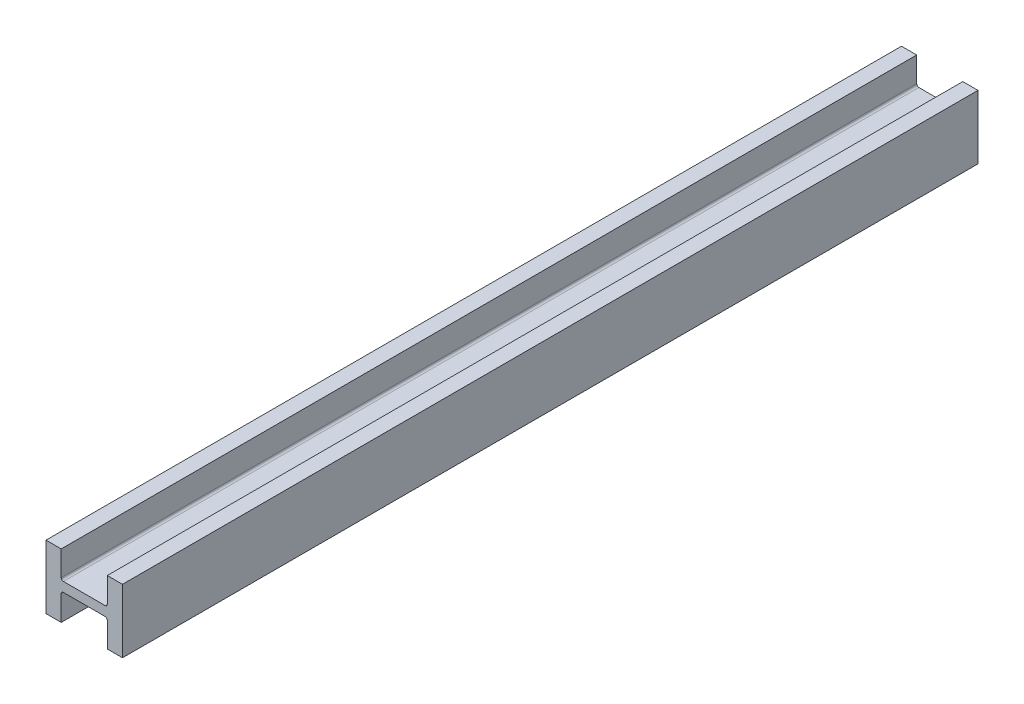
ISO-10303-21;
HEADER;
FILE_DESCRIPTION(('STEP AP214'),'2;1');
FILE_NAME('part.step','',(''),(''),'','','');
FILE_SCHEMA(('AUTOMOTIVE_DESIGN { 1 0 10303 214 1 1 1 1 }'));
ENDSEC;
DATA;
#1=APPLICATION_CONTEXT('core data for automotive mechanical design processes');
#2=APPLICATION_PROTOCOL_DEFINITION('international standard','automotive_design',2000,#1);
#3=PRODUCT_CONTEXT('',#1,'mechanical');
#4=PRODUCT('Part','Part','',(#3));
#5=PRODUCT_RELATED_PRODUCT_CATEGORY('part','',(#4));
#6=PRODUCT_DEFINITION_FORMATION('','',#4);
#7=PRODUCT_DEFINITION_CONTEXT('part definition',#1,'design');
#8=PRODUCT_DEFINITION('design','',#6,#7);
#9=PRODUCT_DEFINITION_SHAPE('','',#8);
#10=(LENGTH_UNIT() NAMED_UNIT(*) SI_UNIT(.MILLI.,.METRE.));
#11=(NAMED_UNIT(*) PLANE_ANGLE_UNIT() SI_UNIT($,.RADIAN.));
#12=(NAMED_UNIT(*) SI_UNIT($,.STERADIAN.) SOLID_ANGLE_UNIT());
#13=UNCERTAINTY_MEASURE_WITH_UNIT(LENGTH_MEASURE(1.E-05),#10,'distance_accuracy_value','');
#14=(GEOMETRIC_REPRESENTATION_CONTEXT(3) GLOBAL_UNCERTAINTY_ASSIGNED_CONTEXT((#13)) GLOBAL_UNIT_ASSIGNED_CONTEXT((#10,
#11,#12)) REPRESENTATION_CONTEXT('',''));
#15=CARTESIAN_POINT('',(0.,0.,0.));
#16=DIRECTION('',(0.,0.,1.));
#17=DIRECTION('',(1.,0.,0.));
#18=AXIS2_PLACEMENT_3D('',#15,#16,#17);
#19=CARTESIAN_POINT('',(265.684,221.1705,2971.8));
#20=DIRECTION('',(-1.,0.,0.));
#21=DIRECTION('',(0.,0.,1.));
#22=AXIS2_PLACEMENT_3D('',#19,#20,#21);
#23=PLANE('',#22);
#24=DIRECTION('',(0.,1.,0.));
#25=VECTOR('',#24,1.);
#26=CARTESIAN_POINT('',(265.684,221.1705,-2971.8));
#27=LINE('',#26,#25);
#28=CARTESIAN_POINT('',(265.684,-221.1705,-2971.8));
#29=VERTEX_POINT('',#28);
#30=CARTESIAN_POINT('',(265.684,221.1705,-2971.8));
#31=VERTEX_POINT('',#30);
#32=EDGE_CURVE('E194',#29,#31,#27,.T.);
#33=ORIENTED_EDGE('',*,*,#32,.T.);
#34=DIRECTION('',(0.,0.,-1.));
#35=VECTOR('',#34,1.);
#36=CARTESIAN_POINT('',(265.684,221.1705,2971.8));
#37=LINE('',#36,#35);
#38=CARTESIAN_POINT('',(265.684,221.1705,2971.8));
#39=VERTEX_POINT('',#38);
#40=EDGE_CURVE('E11',#39,#31,#37,.T.);
#41=ORIENTED_EDGE('',*,*,#40,.F.);
#42=DIRECTION('',(0.,1.,0.));
#43=VECTOR('',#42,1.);
#44=CARTESIAN_POINT('',(265.684,221.1705,2971.8));
#45=LINE('',#44,#43);
#46=CARTESIAN_POINT('',(265.684,-221.1705,2971.8));
#47=VERTEX_POINT('',#46);
#48=EDGE_CURVE('E238',#47,#39,#45,.T.);
#49=ORIENTED_EDGE('',*,*,#48,.F.);
#50=DIRECTION('',(0.,0.,-1.));
#51=VECTOR('',#50,1.);
#52=CARTESIAN_POINT('',(265.684,-221.1705,2971.8));
#53=LINE('',#52,#51);
#54=EDGE_CURVE('E189',#47,#29,#53,.T.);
#55=ORIENTED_EDGE('',*,*,#54,.T.);
#56=EDGE_LOOP('',(#33,#41,#49,#55));
#57=FACE_BOUND('',#56,.T.);
#58=ADVANCED_FACE('F44',(#57),#23,.F.);
#59=CARTESIAN_POINT('',(160.02,221.1705,2971.8));
#60=DIRECTION('',(0.,-1.,0.));
#61=DIRECTION('',(0.,0.,-1.));
#62=AXIS2_PLACEMENT_3D('',#59,#60,#61);
#63=PLANE('',#62);
#64=DIRECTION('',(-1.,0.,0.));
#65=VECTOR('',#64,1.);
#66=CARTESIAN_POINT('',(160.02,221.1705,-2971.8));
#67=LINE('',#66,#65);
#68=CARTESIAN_POINT('',(160.02,221.1705,-2971.8));
#69=VERTEX_POINT('',#68);
#70=EDGE_CURVE('E196',#31,#69,#67,.T.);
#71=ORIENTED_EDGE('',*,*,#70,.T.);
#72=DIRECTION('',(0.,0.,-1.));
#73=VECTOR('',#72,1.);
#74=CARTESIAN_POINT('',(160.02,221.1705,2971.8));
#75=LINE('',#74,#73);
#76=CARTESIAN_POINT('',(160.02,221.1705,2971.8));
#77=VERTEX_POINT('',#76);
#78=EDGE_CURVE('E53',#77,#69,#75,.T.);
#79=ORIENTED_EDGE('',*,*,#78,.F.);
#80=DIRECTION('',(-1.,0.,0.));
#81=VECTOR('',#80,1.);
#82=CARTESIAN_POINT('',(160.02,221.1705,2971.8));
#83=LINE('',#82,#81);
#84=EDGE_CURVE('E129',#39,#77,#83,.T.);
#85=ORIENTED_EDGE('',*,*,#84,.F.);
#86=ORIENTED_EDGE('',*,*,#40,.T.);
#87=EDGE_LOOP('',(#71,#79,#85,#86));
#88=FACE_BOUND('',#87,.T.);
#89=ADVANCED_FACE('F362',(#88),#63,.F.);
#90=CARTESIAN_POINT('',(160.02,48.1965,2971.8));
#91=DIRECTION('',(1.,0.,0.));
#92=DIRECTION('',(0.,0.,-1.));
#93=AXIS2_PLACEMENT_3D('',#90,#91,#92);
#94=PLANE('',#93);
#95=DIRECTION('',(0.,-1.,0.));
#96=VECTOR('',#95,1.);
#97=CARTESIAN_POINT('',(160.02,48.1965,-2971.8));
#98=LINE('',#97,#96);
#99=CARTESIAN_POINT('',(160.02,48.1965,-2971.8));
#100=VERTEX_POINT('',#99);
#101=EDGE_CURVE('E203',#69,#100,#98,.T.);
#102=ORIENTED_EDGE('',*,*,#101,.T.);
#103=DIRECTION('',(0.,0.,-1.));
#104=VECTOR('',#103,1.);
#105=CARTESIAN_POINT('',(160.02,48.1965,2971.8));
#106=LINE('',#105,#104);
#107=CARTESIAN_POINT('',(160.02,48.1965,2971.8));
#108=VERTEX_POINT('',#107);
#109=EDGE_CURVE('E282',#108,#100,#106,.T.);
#110=ORIENTED_EDGE('',*,*,#109,.F.);
#111=DIRECTION('',(0.,-1.,0.));
#112=VECTOR('',#111,1.);
#113=CARTESIAN_POINT('',(160.02,48.1965,2971.8));
#114=LINE('',#113,#112);
#115=EDGE_CURVE('E291',#77,#108,#114,.T.);
#116=ORIENTED_EDGE('',*,*,#115,.F.);
#117=ORIENTED_EDGE('',*,*,#78,.T.);
#118=EDGE_LOOP('',(#102,#110,#116,#117));
#119=FACE_BOUND('',#118,.T.);
#120=ADVANCED_FACE('F292',(#119),#94,.F.);
#121=CARTESIAN_POINT('',(144.78,48.1965,2971.8));
#122=DIRECTION('',(0.,0.,-1.));
#123=DIRECTION('',(-1.,0.,0.));
#124=AXIS2_PLACEMENT_3D('',#121,#122,#123);
#125=CYLINDRICAL_SURFACE('',#124,15.24);
#126=CARTESIAN_POINT('',(144.78,48.1965,-2971.8));
#127=DIRECTION('',(0.,0.,-1.));
#128=DIRECTION('',(1.,0.,0.));
#129=AXIS2_PLACEMENT_3D('',#126,#127,#128);
#130=CIRCLE('',#129,15.24);
#131=CARTESIAN_POINT('',(144.78,32.9565,-2971.8));
#132=VERTEX_POINT('',#131);
#133=EDGE_CURVE('E204',#100,#132,#130,.T.);
#134=ORIENTED_EDGE('',*,*,#133,.T.);
#135=DIRECTION('',(0.,0.,-1.));
#136=VECTOR('',#135,1.);
#137=CARTESIAN_POINT('',(144.78,32.9565,2971.8));
#138=LINE('',#137,#136);
#139=CARTESIAN_POINT('',(144.78,32.9565,2971.8));
#140=VERTEX_POINT('',#139);
#141=EDGE_CURVE('E276',#140,#132,#138,.T.);
#142=ORIENTED_EDGE('',*,*,#141,.F.);
#143=CARTESIAN_POINT('',(144.78,48.1965,2971.8));
#144=DIRECTION('',(0.,0.,-1.));
#145=DIRECTION('',(1.,0.,0.));
#146=AXIS2_PLACEMENT_3D('',#143,#144,#145);
#147=CIRCLE('',#146,15.24);
#148=EDGE_CURVE('E315',#108,#140,#147,.T.);
#149=ORIENTED_EDGE('',*,*,#148,.F.);
#150=ORIENTED_EDGE('',*,*,#109,.T.);
#151=EDGE_LOOP('',(#134,#142,#149,#150));
#152=FACE_BOUND('',#151,.T.);
#153=ADVANCED_FACE('F305',(#152),#125,.F.);
#154=CARTESIAN_POINT('',(-144.78,32.9565,2971.8));
#155=DIRECTION('',(0.,-1.,0.));
#156=DIRECTION('',(1.,0.,0.));
#157=AXIS2_PLACEMENT_3D('',#154,#155,#156);
#158=PLANE('',#157);
#159=DIRECTION('',(-1.,0.,0.));
#160=VECTOR('',#159,1.);
#161=CARTESIAN_POINT('',(-144.78,32.9565,-2971.8));
#162=LINE('',#161,#160);
#163=CARTESIAN_POINT('',(-144.78,32.9565,-2971.8));
#164=VERTEX_POINT('',#163);
#165=EDGE_CURVE('E210',#132,#164,#162,.T.);
#166=ORIENTED_EDGE('',*,*,#165,.T.);
#167=DIRECTION('',(0.,0.,-1.));
#168=VECTOR('',#167,1.);
#169=CARTESIAN_POINT('',(-144.78,32.9565,2971.8));
#170=LINE('',#169,#168);
#171=CARTESIAN_POINT('',(-144.78,32.9565,2971.8));
#172=VERTEX_POINT('',#171);
#173=EDGE_CURVE('E274',#172,#164,#170,.T.);
#174=ORIENTED_EDGE('',*,*,#173,.F.);
#175=DIRECTION('',(-1.,0.,0.));
#176=VECTOR('',#175,1.);
#177=CARTESIAN_POINT('',(-144.78,32.9565,2971.8));
#178=LINE('',#177,#176);
#179=EDGE_CURVE('E306',#140,#172,#178,.T.);
#180=ORIENTED_EDGE('',*,*,#179,.F.);
#181=ORIENTED_EDGE('',*,*,#141,.T.);
#182=EDGE_LOOP('',(#166,#174,#180,#181));
#183=FACE_BOUND('',#182,.T.);
#184=ADVANCED_FACE('F308',(#183),#158,.F.);
#185=CARTESIAN_POINT('',(-144.78,48.1965,2971.8));
#186=DIRECTION('',(0.,0.,-1.));
#187=DIRECTION('',(-1.,0.,0.));
#188=AXIS2_PLACEMENT_3D('',#185,#186,#187);
#189=CYLINDRICAL_SURFACE('',#188,15.24);
#190=CARTESIAN_POINT('',(-144.78,48.1965,-2971.8));
#191=DIRECTION('',(0.,0.,-1.));
#192=DIRECTION('',(1.,0.,0.));
#193=AXIS2_PLACEMENT_3D('',#190,#191,#192);
#194=CIRCLE('',#193,15.24);
#195=CARTESIAN_POINT('',(-160.02,48.1965,-2971.8));
#196=VERTEX_POINT('',#195);
#197=EDGE_CURVE('E209',#164,#196,#194,.T.);
#198=ORIENTED_EDGE('',*,*,#197,.T.);
#199=DIRECTION('',(0.,0.,-1.));
#200=VECTOR('',#199,1.);
#201=CARTESIAN_POINT('',(-160.02,48.1965,2971.8));
#202=LINE('',#201,#200);
#203=CARTESIAN_POINT('',(-160.02,48.1965,2971.8));
#204=VERTEX_POINT('',#203);
#205=EDGE_CURVE('E271',#204,#196,#202,.T.);
#206=ORIENTED_EDGE('',*,*,#205,.F.);
#207=CARTESIAN_POINT('',(-144.78,48.1965,2971.8));
#208=DIRECTION('',(0.,0.,-1.));
#209=DIRECTION('',(1.,0.,0.));
#210=AXIS2_PLACEMENT_3D('',#207,#208,#209);
#211=CIRCLE('',#210,15.24);
#212=EDGE_CURVE('E313',#172,#204,#211,.T.);
#213=ORIENTED_EDGE('',*,*,#212,.F.);
#214=ORIENTED_EDGE('',*,*,#173,.T.);
#215=EDGE_LOOP('',(#198,#206,#213,#214));
#216=FACE_BOUND('',#215,.T.);
#217=ADVANCED_FACE('F374',(#216),#189,.F.);
#218=CARTESIAN_POINT('',(-160.02,221.1705,2971.8));
#219=DIRECTION('',(-1.,0.,0.));
#220=DIRECTION('',(0.,0.,1.));
#221=AXIS2_PLACEMENT_3D('',#218,#219,#220);
#222=PLANE('',#221);
#223=DIRECTION('',(0.,1.,0.));
#224=VECTOR('',#223,1.);
#225=CARTESIAN_POINT('',(-160.02,221.1705,-2971.8));
#226=LINE('',#225,#224);
#227=CARTESIAN_POINT('',(-160.02,221.1705,-2971.8));
#228=VERTEX_POINT('',#227);
#229=EDGE_CURVE('E213',#196,#228,#226,.T.);
#230=ORIENTED_EDGE('',*,*,#229,.T.);
#231=DIRECTION('',(0.,0.,-1.));
#232=VECTOR('',#231,1.);
#233=CARTESIAN_POINT('',(-160.02,221.1705,2971.8));
#234=LINE('',#233,#232);
#235=CARTESIAN_POINT('',(-160.02,221.1705,2971.8));
#236=VERTEX_POINT('',#235);
#237=EDGE_CURVE('E270',#236,#228,#234,.T.);
#238=ORIENTED_EDGE('',*,*,#237,.F.);
#239=DIRECTION('',(0.,1.,0.));
#240=VECTOR('',#239,1.);
#241=CARTESIAN_POINT('',(-160.02,221.1705,2971.8));
#242=LINE('',#241,#240);
#243=EDGE_CURVE('E316',#204,#236,#242,.T.);
#244=ORIENTED_EDGE('',*,*,#243,.F.);
#245=ORIENTED_EDGE('',*,*,#205,.T.);
#246=EDGE_LOOP('',(#230,#238,#244,#245));
#247=FACE_BOUND('',#246,.T.);
#248=ADVANCED_FACE('F378',(#247),#222,.F.);
#249=CARTESIAN_POINT('',(-265.684,221.1705,2971.8));
#250=DIRECTION('',(0.,-1.,0.));
#251=DIRECTION('',(0.,0.,-1.));
#252=AXIS2_PLACEMENT_3D('',#249,#250,#251);
#253=PLANE('',#252);
#254=DIRECTION('',(-1.,0.,0.));
#255=VECTOR('',#254,1.);
#256=CARTESIAN_POINT('',(-265.684,221.1705,-2971.8));
#257=LINE('',#256,#255);
#258=CARTESIAN_POINT('',(-265.684,221.1705,-2971.8));
#259=VERTEX_POINT('',#258);
#260=EDGE_CURVE('E216',#228,#259,#257,.T.);
#261=ORIENTED_EDGE('',*,*,#260,.T.);
#262=DIRECTION('',(0.,0.,-1.));
#263=VECTOR('',#262,1.);
#264=CARTESIAN_POINT('',(-265.684,221.1705,2971.8));
#265=LINE('',#264,#263);
#266=CARTESIAN_POINT('',(-265.684,221.1705,2971.8));
#267=VERTEX_POINT('',#266);
#268=EDGE_CURVE('E263',#267,#259,#265,.T.);
#269=ORIENTED_EDGE('',*,*,#268,.F.);
#270=DIRECTION('',(-1.,0.,0.));
#271=VECTOR('',#270,1.);
#272=CARTESIAN_POINT('',(-265.684,221.1705,2971.8));
#273=LINE('',#272,#271);
#274=EDGE_CURVE('E323',#236,#267,#273,.T.);
#275=ORIENTED_EDGE('',*,*,#274,.F.);
#276=ORIENTED_EDGE('',*,*,#237,.T.);
#277=EDGE_LOOP('',(#261,#269,#275,#276));
#278=FACE_BOUND('',#277,.T.);
#279=ADVANCED_FACE('F385',(#278),#253,.F.);
#280=CARTESIAN_POINT('',(-265.684,-221.1705,2971.8));
#281=DIRECTION('',(1.,0.,0.));
#282=DIRECTION('',(0.,0.,-1.));
#283=AXIS2_PLACEMENT_3D('',#280,#281,#282);
#284=PLANE('',#283);
#285=DIRECTION('',(0.,-1.,0.));
#286=VECTOR('',#285,1.);
#287=CARTESIAN_POINT('',(-265.684,-221.1705,-2971.8));
#288=LINE('',#287,#286);
#289=CARTESIAN_POINT('',(-265.684,-221.1705,-2971.8));
#290=VERTEX_POINT('',#289);
#291=EDGE_CURVE('E218',#259,#290,#288,.T.);
#292=ORIENTED_EDGE('',*,*,#291,.T.);
#293=DIRECTION('',(0.,0.,-1.));
#294=VECTOR('',#293,1.);
#295=CARTESIAN_POINT('',(-265.684,-221.1705,2971.8));
#296=LINE('',#295,#294);
#297=CARTESIAN_POINT('',(-265.684,-221.1705,2971.8));
#298=VERTEX_POINT('',#297);
#299=EDGE_CURVE('E259',#298,#290,#296,.T.);
#300=ORIENTED_EDGE('',*,*,#299,.F.);
#301=DIRECTION('',(0.,-1.,0.));
#302=VECTOR('',#301,1.);
#303=CARTESIAN_POINT('',(-265.684,-221.1705,2971.8));
#304=LINE('',#303,#302);
#305=EDGE_CURVE('E326',#267,#298,#304,.T.);
#306=ORIENTED_EDGE('',*,*,#305,.F.);
#307=ORIENTED_EDGE('',*,*,#268,.T.);
#308=EDGE_LOOP('',(#292,#300,#306,#307));
#309=FACE_BOUND('',#308,.T.);
#310=ADVANCED_FACE('F387',(#309),#284,.F.);
#311=CARTESIAN_POINT('',(-160.02,-221.1705,2971.8));
#312=DIRECTION('',(0.,1.,0.));
#313=DIRECTION('',(0.,0.,1.));
#314=AXIS2_PLACEMENT_3D('',#311,#312,#313);
#315=PLANE('',#314);
#316=DIRECTION('',(1.,0.,0.));
#317=VECTOR('',#316,1.);
#318=CARTESIAN_POINT('',(-160.02,-221.1705,-2971.8));
#319=LINE('',#318,#317);
#320=CARTESIAN_POINT('',(-160.02,-221.1705,-2971.8));
#321=VERTEX_POINT('',#320);
#322=EDGE_CURVE('E225',#290,#321,#319,.T.);
#323=ORIENTED_EDGE('',*,*,#322,.T.);
#324=DIRECTION('',(0.,0.,-1.));
#325=VECTOR('',#324,1.);
#326=CARTESIAN_POINT('',(-160.02,-221.1705,2971.8));
#327=LINE('',#326,#325);
#328=CARTESIAN_POINT('',(-160.02,-221.1705,2971.8));
#329=VERTEX_POINT('',#328);
#330=EDGE_CURVE('E254',#329,#321,#327,.T.);
#331=ORIENTED_EDGE('',*,*,#330,.F.);
#332=DIRECTION('',(1.,0.,0.));
#333=VECTOR('',#332,1.);
#334=CARTESIAN_POINT('',(-160.02,-221.1705,2971.8));
#335=LINE('',#334,#333);
#336=EDGE_CURVE('E328',#298,#329,#335,.T.);
#337=ORIENTED_EDGE('',*,*,#336,.F.);
#338=ORIENTED_EDGE('',*,*,#299,.T.);
#339=EDGE_LOOP('',(#323,#331,#337,#338));
#340=FACE_BOUND('',#339,.T.);
#341=ADVANCED_FACE('F388',(#340),#315,.F.);
#342=CARTESIAN_POINT('',(-160.02,-48.1965,2971.8));
#343=DIRECTION('',(-1.,0.,0.));
#344=DIRECTION('',(0.,-1.,0.));
#345=AXIS2_PLACEMENT_3D('',#342,#343,#344);
#346=PLANE('',#345);
#347=DIRECTION('',(0.,1.,0.));
#348=VECTOR('',#347,1.);
#349=CARTESIAN_POINT('',(-160.02,-48.1965,-2971.8));
#350=LINE('',#349,#348);
#351=CARTESIAN_POINT('',(-160.02,-48.1965,-2971.8));
#352=VERTEX_POINT('',#351);
#353=EDGE_CURVE('E223',#321,#352,#350,.T.);
#354=ORIENTED_EDGE('',*,*,#353,.T.);
#355=DIRECTION('',(0.,0.,-1.));
#356=VECTOR('',#355,1.);
#357=CARTESIAN_POINT('',(-160.02,-48.1965,2971.8));
#358=LINE('',#357,#356);
#359=CARTESIAN_POINT('',(-160.02,-48.1965,2971.8));
#360=VERTEX_POINT('',#359);
#361=EDGE_CURVE('E253',#360,#352,#358,.T.);
#362=ORIENTED_EDGE('',*,*,#361,.F.);
#363=DIRECTION('',(0.,1.,0.));
#364=VECTOR('',#363,1.);
#365=CARTESIAN_POINT('',(-160.02,-48.1965,2971.8));
#366=LINE('',#365,#364);
#367=EDGE_CURVE('E335',#329,#360,#366,.T.);
#368=ORIENTED_EDGE('',*,*,#367,.F.);
#369=ORIENTED_EDGE('',*,*,#330,.T.);
#370=EDGE_LOOP('',(#354,#362,#368,#369));
#371=FACE_BOUND('',#370,.T.);
#372=ADVANCED_FACE('F393',(#371),#346,.F.);
#373=CARTESIAN_POINT('',(-144.78,-48.1965,2971.8));
#374=DIRECTION('',(0.,0.,-1.));
#375=DIRECTION('',(-1.,0.,0.));
#376=AXIS2_PLACEMENT_3D('',#373,#374,#375);
#377=CYLINDRICAL_SURFACE('',#376,15.24);
#378=CARTESIAN_POINT('',(-144.78,-48.1965,-2971.8));
#379=DIRECTION('',(0.,0.,-1.));
#380=DIRECTION('',(1.,0.,0.));
#381=AXIS2_PLACEMENT_3D('',#378,#379,#380);
#382=CIRCLE('',#381,15.24);
#383=CARTESIAN_POINT('',(-144.78,-32.9565,-2971.8));
#384=VERTEX_POINT('',#383);
#385=EDGE_CURVE('E227',#352,#384,#382,.T.);
#386=ORIENTED_EDGE('',*,*,#385,.T.);
#387=DIRECTION('',(0.,0.,-1.));
#388=VECTOR('',#387,1.);
#389=CARTESIAN_POINT('',(-144.78,-32.9565,2971.8));
#390=LINE('',#389,#388);
#391=CARTESIAN_POINT('',(-144.78,-32.9565,2971.8));
#392=VERTEX_POINT('',#391);
#393=EDGE_CURVE('E250',#392,#384,#390,.T.);
#394=ORIENTED_EDGE('',*,*,#393,.F.);
#395=CARTESIAN_POINT('',(-144.78,-48.1965,2971.8));
#396=DIRECTION('',(0.,0.,-1.));
#397=DIRECTION('',(1.,0.,0.));
#398=AXIS2_PLACEMENT_3D('',#395,#396,#397);
#399=CIRCLE('',#398,15.24);
#400=EDGE_CURVE('E333',#360,#392,#399,.T.);
#401=ORIENTED_EDGE('',*,*,#400,.F.);
#402=ORIENTED_EDGE('',*,*,#361,.T.);
#403=EDGE_LOOP('',(#386,#394,#401,#402));
#404=FACE_BOUND('',#403,.T.);
#405=ADVANCED_FACE('F343',(#404),#377,.F.);
#406=CARTESIAN_POINT('',(144.78,-32.9565,2971.8));
#407=DIRECTION('',(0.,1.,0.));
#408=DIRECTION('',(-1.,0.,0.));
#409=AXIS2_PLACEMENT_3D('',#406,#407,#408);
#410=PLANE('',#409);
#411=DIRECTION('',(1.,0.,0.));
#412=VECTOR('',#411,1.);
#413=CARTESIAN_POINT('',(144.78,-32.9565,-2971.8));
#414=LINE('',#413,#412);
#415=CARTESIAN_POINT('',(144.78,-32.9565,-2971.8));
#416=VERTEX_POINT('',#415);
#417=EDGE_CURVE('E232',#384,#416,#414,.T.);
#418=ORIENTED_EDGE('',*,*,#417,.T.);
#419=DIRECTION('',(0.,0.,-1.));
#420=VECTOR('',#419,1.);
#421=CARTESIAN_POINT('',(144.78,-32.9565,2971.8));
#422=LINE('',#421,#420);
#423=CARTESIAN_POINT('',(144.78,-32.9565,2971.8));
#424=VERTEX_POINT('',#423);
#425=EDGE_CURVE('E181',#424,#416,#422,.T.);
#426=ORIENTED_EDGE('',*,*,#425,.F.);
#427=DIRECTION('',(1.,0.,0.));
#428=VECTOR('',#427,1.);
#429=CARTESIAN_POINT('',(144.78,-32.9565,2971.8));
#430=LINE('',#429,#428);
#431=EDGE_CURVE('E175',#392,#424,#430,.T.);
#432=ORIENTED_EDGE('',*,*,#431,.F.);
#433=ORIENTED_EDGE('',*,*,#393,.T.);
#434=EDGE_LOOP('',(#418,#426,#432,#433));
#435=FACE_BOUND('',#434,.T.);
#436=ADVANCED_FACE('F350',(#435),#410,.F.);
#437=CARTESIAN_POINT('',(144.78,-48.1965,2971.8));
#438=DIRECTION('',(0.,0.,-1.));
#439=DIRECTION('',(-1.,0.,0.));
#440=AXIS2_PLACEMENT_3D('',#437,#438,#439);
#441=CYLINDRICAL_SURFACE('',#440,15.24);
#442=CARTESIAN_POINT('',(144.78,-48.1965,-2971.8));
#443=DIRECTION('',(0.,0.,-1.));
#444=DIRECTION('',(1.,0.,0.));
#445=AXIS2_PLACEMENT_3D('',#442,#443,#444);
#446=CIRCLE('',#445,15.24);
#447=CARTESIAN_POINT('',(160.02,-48.1965,-2971.8));
#448=VERTEX_POINT('',#447);
#449=EDGE_CURVE('E182',#416,#448,#446,.T.);
#450=ORIENTED_EDGE('',*,*,#449,.T.);
#451=DIRECTION('',(0.,0.,-1.));
#452=VECTOR('',#451,1.);
#453=CARTESIAN_POINT('',(160.02,-48.1965,2971.8));
#454=LINE('',#453,#452);
#455=CARTESIAN_POINT('',(160.02,-48.1965,2971.8));
#456=VERTEX_POINT('',#455);
#457=EDGE_CURVE('E178',#456,#448,#454,.T.);
#458=ORIENTED_EDGE('',*,*,#457,.F.);
#459=CARTESIAN_POINT('',(144.78,-48.1965,2971.8));
#460=DIRECTION('',(0.,0.,-1.));
#461=DIRECTION('',(1.,0.,0.));
#462=AXIS2_PLACEMENT_3D('',#459,#460,#461);
#463=CIRCLE('',#462,15.24);
#464=EDGE_CURVE('E167',#424,#456,#463,.T.);
#465=ORIENTED_EDGE('',*,*,#464,.F.);
#466=ORIENTED_EDGE('',*,*,#425,.T.);
#467=EDGE_LOOP('',(#450,#458,#465,#466));
#468=FACE_BOUND('',#467,.T.);
#469=ADVANCED_FACE('F179',(#468),#441,.F.);
#470=CARTESIAN_POINT('',(160.02,-221.1705,2971.8));
#471=DIRECTION('',(1.,0.,0.));
#472=DIRECTION('',(0.,0.,-1.));
#473=AXIS2_PLACEMENT_3D('',#470,#471,#472);
#474=PLANE('',#473);
#475=DIRECTION('',(0.,-1.,0.));
#476=VECTOR('',#475,1.);
#477=CARTESIAN_POINT('',(160.02,-221.1705,-2971.8));
#478=LINE('',#477,#476);
#479=CARTESIAN_POINT('',(160.02,-221.1705,-2971.8));
#480=VERTEX_POINT('',#479);
#481=EDGE_CURVE('E113',#448,#480,#478,.T.);
#482=ORIENTED_EDGE('',*,*,#481,.T.);
#483=DIRECTION('',(0.,0.,-1.));
#484=VECTOR('',#483,1.);
#485=CARTESIAN_POINT('',(160.02,-221.1705,2971.8));
#486=LINE('',#485,#484);
#487=CARTESIAN_POINT('',(160.02,-221.1705,2971.8));
#488=VERTEX_POINT('',#487);
#489=EDGE_CURVE('E184',#488,#480,#486,.T.);
#490=ORIENTED_EDGE('',*,*,#489,.F.);
#491=DIRECTION('',(0.,-1.,0.));
#492=VECTOR('',#491,1.);
#493=CARTESIAN_POINT('',(160.02,-221.1705,2971.8));
#494=LINE('',#493,#492);
#495=EDGE_CURVE('E168',#456,#488,#494,.T.);
#496=ORIENTED_EDGE('',*,*,#495,.F.);
#497=ORIENTED_EDGE('',*,*,#457,.T.);
#498=EDGE_LOOP('',(#482,#490,#496,#497));
#499=FACE_BOUND('',#498,.T.);
#500=ADVANCED_FACE('F186',(#499),#474,.F.);
#501=CARTESIAN_POINT('',(265.684,-221.1705,2971.8));
#502=DIRECTION('',(0.,1.,0.));
#503=DIRECTION('',(0.,0.,1.));
#504=AXIS2_PLACEMENT_3D('',#501,#502,#503);
#505=PLANE('',#504);
#506=DIRECTION('',(1.,0.,0.));
#507=VECTOR('',#506,1.);
#508=CARTESIAN_POINT('',(265.684,-221.1705,-2971.8));
#509=LINE('',#508,#507);
#510=EDGE_CURVE('E122',#480,#29,#509,.T.);
#511=ORIENTED_EDGE('',*,*,#510,.T.);
#512=ORIENTED_EDGE('',*,*,#54,.F.);
#513=DIRECTION('',(1.,0.,0.));
#514=VECTOR('',#513,1.);
#515=CARTESIAN_POINT('',(265.684,-221.1705,2971.8));
#516=LINE('',#515,#514);
#517=EDGE_CURVE('E65',#488,#47,#516,.T.);
#518=ORIENTED_EDGE('',*,*,#517,.F.);
#519=ORIENTED_EDGE('',*,*,#489,.T.);
#520=EDGE_LOOP('',(#511,#512,#518,#519));
#521=FACE_BOUND('',#520,.T.);
#522=ADVANCED_FACE('F351',(#521),#505,.F.);
#523=CARTESIAN_POINT('',(144.78,-48.1965,2971.8));
#524=DIRECTION('',(0.,0.,1.));
#525=DIRECTION('',(1.,0.,0.));
#526=AXIS2_PLACEMENT_3D('',#523,#524,#525);
#527=PLANE('',#526);
#528=ORIENTED_EDGE('',*,*,#48,.T.);
#529=ORIENTED_EDGE('',*,*,#84,.T.);
#530=ORIENTED_EDGE('',*,*,#115,.T.);
#531=ORIENTED_EDGE('',*,*,#148,.T.);
#532=ORIENTED_EDGE('',*,*,#179,.T.);
#533=ORIENTED_EDGE('',*,*,#212,.T.);
#534=ORIENTED_EDGE('',*,*,#243,.T.);
#535=ORIENTED_EDGE('',*,*,#274,.T.);
#536=ORIENTED_EDGE('',*,*,#305,.T.);
#537=ORIENTED_EDGE('',*,*,#336,.T.);
#538=ORIENTED_EDGE('',*,*,#367,.T.);
#539=ORIENTED_EDGE('',*,*,#400,.T.);
#540=ORIENTED_EDGE('',*,*,#431,.T.);
#541=ORIENTED_EDGE('',*,*,#464,.T.);
#542=ORIENTED_EDGE('',*,*,#495,.T.);
#543=ORIENTED_EDGE('',*,*,#517,.T.);
#544=EDGE_LOOP('',(#528,#529,#530,#531,#532,#533,#534,#535,#536,#537,#538,#539,#540,#541,#542,#543));
#545=FACE_BOUND('',#544,.T.);
#546=ADVANCED_FACE('F169',(#545),#527,.T.);
#547=CARTESIAN_POINT('',(144.78,-48.1965,-2971.8));
#548=DIRECTION('',(0.,0.,1.));
#549=DIRECTION('',(1.,0.,0.));
#550=AXIS2_PLACEMENT_3D('',#547,#548,#549);
#551=PLANE('',#550);
#552=ORIENTED_EDGE('',*,*,#32,.F.);
#553=ORIENTED_EDGE('',*,*,#510,.F.);
#554=ORIENTED_EDGE('',*,*,#481,.F.);
#555=ORIENTED_EDGE('',*,*,#449,.F.);
#556=ORIENTED_EDGE('',*,*,#417,.F.);
#557=ORIENTED_EDGE('',*,*,#385,.F.);
#558=ORIENTED_EDGE('',*,*,#353,.F.);
#559=ORIENTED_EDGE('',*,*,#322,.F.);
#560=ORIENTED_EDGE('',*,*,#291,.F.);
#561=ORIENTED_EDGE('',*,*,#260,.F.);
#562=ORIENTED_EDGE('',*,*,#229,.F.);
#563=ORIENTED_EDGE('',*,*,#197,.F.);
#564=ORIENTED_EDGE('',*,*,#165,.F.);
#565=ORIENTED_EDGE('',*,*,#133,.F.);
#566=ORIENTED_EDGE('',*,*,#101,.F.);
#567=ORIENTED_EDGE('',*,*,#70,.F.);
#568=EDGE_LOOP('',(#552,#553,#554,#555,#556,#557,#558,#559,#560,#561,#562,#563,#564,#565,#566,#567));
#569=FACE_BOUND('',#568,.T.);
#570=ADVANCED_FACE('F300',(#569),#551,.F.);
#571=CLOSED_SHELL('',(#58,#89,#120,#153,#184,#217,#248,#279,#310,#341,#372,#405,#436,#469,#500,
#522,#546,#570));
#572=MANIFOLD_SOLID_BREP('B2',#571);
#573=ADVANCED_BREP_SHAPE_REPRESENTATION('',(#18,#572),#14);
#574=SHAPE_DEFINITION_REPRESENTATION(#9,#573);
ENDSEC;
END-ISO-10303-21;
